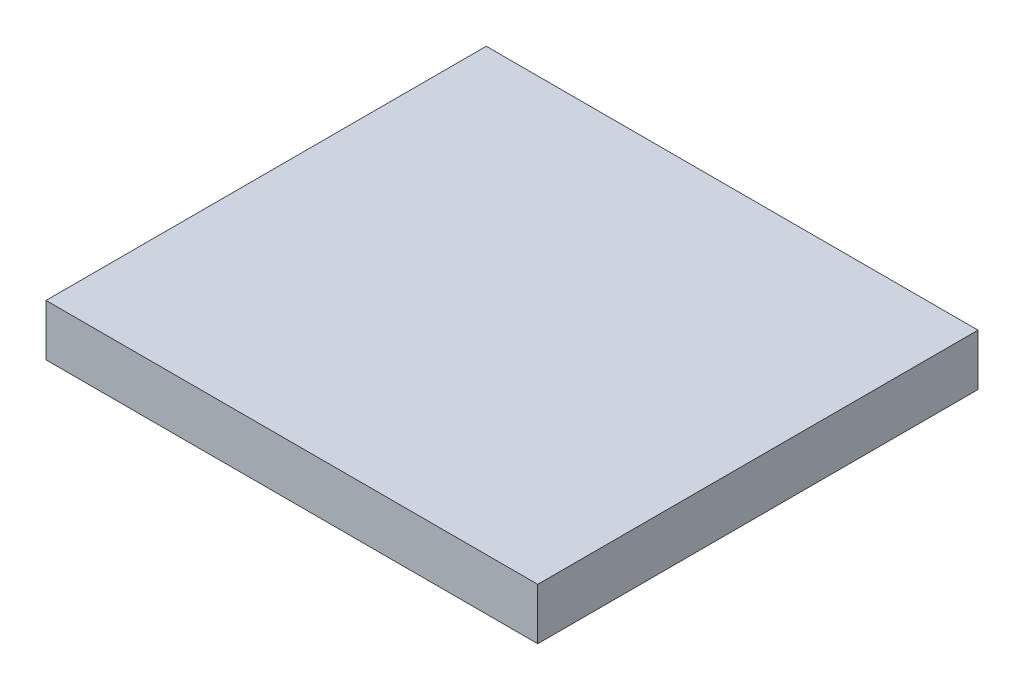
ISO-10303-21;
HEADER;
FILE_DESCRIPTION(('STEP AP214'),'2;1');
FILE_NAME('part.step','',(''),(''),'','','');
FILE_SCHEMA(('AUTOMOTIVE_DESIGN { 1 0 10303 214 1 1 1 1 }'));
ENDSEC;
DATA;
#1=APPLICATION_CONTEXT('core data for automotive mechanical design processes');
#2=APPLICATION_PROTOCOL_DEFINITION('international standard','automotive_design',2000,#1);
#3=PRODUCT_CONTEXT('',#1,'mechanical');
#4=PRODUCT('Part','Part','',(#3));
#5=PRODUCT_RELATED_PRODUCT_CATEGORY('part','',(#4));
#6=PRODUCT_DEFINITION_FORMATION('','',#4);
#7=PRODUCT_DEFINITION_CONTEXT('part definition',#1,'design');
#8=PRODUCT_DEFINITION('design','',#6,#7);
#9=PRODUCT_DEFINITION_SHAPE('','',#8);
#10=(LENGTH_UNIT() NAMED_UNIT(*) SI_UNIT(.MILLI.,.METRE.));
#11=(NAMED_UNIT(*) PLANE_ANGLE_UNIT() SI_UNIT($,.RADIAN.));
#12=(NAMED_UNIT(*) SI_UNIT($,.STERADIAN.) SOLID_ANGLE_UNIT());
#13=UNCERTAINTY_MEASURE_WITH_UNIT(LENGTH_MEASURE(1.E-05),#10,'distance_accuracy_value','');
#14=(GEOMETRIC_REPRESENTATION_CONTEXT(3) GLOBAL_UNCERTAINTY_ASSIGNED_CONTEXT((#13)) GLOBAL_UNIT_ASSIGNED_CONTEXT((#10,
#11,#12)) REPRESENTATION_CONTEXT('',''));
#15=CARTESIAN_POINT('',(0.,0.,0.));
#16=DIRECTION('',(0.,0.,1.));
#17=DIRECTION('',(1.,0.,0.));
#18=AXIS2_PLACEMENT_3D('',#15,#16,#17);
#19=CARTESIAN_POINT('',(-1.11022302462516E-13,9.65199999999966,3.33066907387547E-13));
#20=DIRECTION('',(1.,0.,0.));
#21=DIRECTION('',(0.,0.,-1.));
#22=AXIS2_PLACEMENT_3D('',#19,#20,#21);
#23=PLANE('',#22);
#24=DIRECTION('',(0.,0.,1.));
#25=VECTOR('',#24,1.);
#26=CARTESIAN_POINT('',(0.,0.,0.));
#27=LINE('',#26,#25);
#28=CARTESIAN_POINT('',(-2.22044604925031E-13,-2.22044604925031E-13,-82.5499999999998));
#29=VERTEX_POINT('',#28);
#30=CARTESIAN_POINT('',(0.,0.,0.));
#31=VERTEX_POINT('',#30);
#32=EDGE_CURVE('E70',#29,#31,#27,.T.);
#33=ORIENTED_EDGE('',*,*,#32,.T.);
#34=DIRECTION('',(0.,-1.,0.));
#35=VECTOR('',#34,1.);
#36=CARTESIAN_POINT('',(-1.11022302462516E-13,9.65199999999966,3.33066907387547E-13));
#37=LINE('',#36,#35);
#38=CARTESIAN_POINT('',(-1.11022302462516E-13,9.65199999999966,3.33066907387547E-13));
#39=VERTEX_POINT('',#38);
#40=EDGE_CURVE('E11',#39,#31,#37,.T.);
#41=ORIENTED_EDGE('',*,*,#40,.F.);
#42=DIRECTION('',(0.,0.,1.));
#43=VECTOR('',#42,1.);
#44=CARTESIAN_POINT('',(-1.11022302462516E-13,9.65199999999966,3.33066907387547E-13));
#45=LINE('',#44,#43);
#46=CARTESIAN_POINT('',(-1.11022302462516E-13,9.65199999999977,-82.5499999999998));
#47=VERTEX_POINT('',#46);
#48=EDGE_CURVE('E88',#47,#39,#45,.T.);
#49=ORIENTED_EDGE('',*,*,#48,.F.);
#50=DIRECTION('',(0.,-1.,0.));
#51=VECTOR('',#50,1.);
#52=CARTESIAN_POINT('',(-1.11022302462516E-13,9.65199999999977,-82.5499999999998));
#53=LINE('',#52,#51);
#54=EDGE_CURVE('E82',#47,#29,#53,.T.);
#55=ORIENTED_EDGE('',*,*,#54,.T.);
#56=EDGE_LOOP('',(#33,#41,#49,#55));
#57=FACE_BOUND('',#56,.T.);
#58=ADVANCED_FACE('F26',(#57),#23,.F.);
#59=CARTESIAN_POINT('',(-1.11022302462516E-13,9.65199999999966,3.33066907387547E-13));
#60=DIRECTION('',(0.,0.,-1.));
#61=DIRECTION('',(-1.,0.,0.));
#62=AXIS2_PLACEMENT_3D('',#59,#60,#61);
#63=PLANE('',#62);
#64=DIRECTION('',(1.,0.,0.));
#65=VECTOR('',#64,1.);
#66=CARTESIAN_POINT('',(0.,0.,0.));
#67=LINE('',#66,#65);
#68=CARTESIAN_POINT('',(92.202,-2.22044604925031E-13,6.66133814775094E-13));
#69=VERTEX_POINT('',#68);
#70=EDGE_CURVE('E66',#31,#69,#67,.T.);
#71=ORIENTED_EDGE('',*,*,#70,.T.);
#72=DIRECTION('',(0.,-1.,0.));
#73=VECTOR('',#72,1.);
#74=CARTESIAN_POINT('',(92.2020000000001,9.65199999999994,3.33066907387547E-13));
#75=LINE('',#74,#73);
#76=CARTESIAN_POINT('',(92.2020000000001,9.65199999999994,3.33066907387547E-13));
#77=VERTEX_POINT('',#76);
#78=EDGE_CURVE('E33',#77,#69,#75,.T.);
#79=ORIENTED_EDGE('',*,*,#78,.F.);
#80=DIRECTION('',(1.,0.,0.));
#81=VECTOR('',#80,1.);
#82=CARTESIAN_POINT('',(-1.11022302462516E-13,9.65199999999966,3.33066907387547E-13));
#83=LINE('',#82,#81);
#84=EDGE_CURVE('E78',#39,#77,#83,.T.);
#85=ORIENTED_EDGE('',*,*,#84,.F.);
#86=ORIENTED_EDGE('',*,*,#40,.T.);
#87=EDGE_LOOP('',(#71,#79,#85,#86));
#88=FACE_BOUND('',#87,.T.);
#89=ADVANCED_FACE('F77',(#88),#63,.F.);
#90=CARTESIAN_POINT('',(92.2020000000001,9.65199999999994,3.33066907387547E-13));
#91=DIRECTION('',(-1.,0.,0.));
#92=DIRECTION('',(0.,0.,1.));
#93=AXIS2_PLACEMENT_3D('',#90,#91,#92);
#94=PLANE('',#93);
#95=DIRECTION('',(0.,0.,-1.));
#96=VECTOR('',#95,1.);
#97=CARTESIAN_POINT('',(92.202,-2.22044604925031E-13,6.66133814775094E-13));
#98=LINE('',#97,#96);
#99=CARTESIAN_POINT('',(92.2019999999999,-1.66533453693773E-13,-82.55));
#100=VERTEX_POINT('',#99);
#101=EDGE_CURVE('E71',#69,#100,#98,.T.);
#102=ORIENTED_EDGE('',*,*,#101,.T.);
#103=DIRECTION('',(0.,-1.,0.));
#104=VECTOR('',#103,1.);
#105=CARTESIAN_POINT('',(92.202,9.65199999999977,-82.55));
#106=LINE('',#105,#104);
#107=CARTESIAN_POINT('',(92.202,9.65199999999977,-82.55));
#108=VERTEX_POINT('',#107);
#109=EDGE_CURVE('E94',#108,#100,#106,.T.);
#110=ORIENTED_EDGE('',*,*,#109,.F.);
#111=DIRECTION('',(0.,0.,-1.));
#112=VECTOR('',#111,1.);
#113=CARTESIAN_POINT('',(92.2020000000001,9.65199999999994,3.33066907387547E-13));
#114=LINE('',#113,#112);
#115=EDGE_CURVE('E45',#77,#108,#114,.T.);
#116=ORIENTED_EDGE('',*,*,#115,.F.);
#117=ORIENTED_EDGE('',*,*,#78,.T.);
#118=EDGE_LOOP('',(#102,#110,#116,#117));
#119=FACE_BOUND('',#118,.T.);
#120=ADVANCED_FACE('F97',(#119),#94,.F.);
#121=CARTESIAN_POINT('',(-1.11022302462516E-13,9.65199999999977,-82.5499999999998));
#122=DIRECTION('',(0.,0.,1.));
#123=DIRECTION('',(1.,0.,0.));
#124=AXIS2_PLACEMENT_3D('',#121,#122,#123);
#125=PLANE('',#124);
#126=DIRECTION('',(-1.,0.,0.));
#127=VECTOR('',#126,1.);
#128=CARTESIAN_POINT('',(-2.22044604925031E-13,-2.22044604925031E-13,-82.5499999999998));
#129=LINE('',#128,#127);
#130=EDGE_CURVE('E86',#100,#29,#129,.T.);
#131=ORIENTED_EDGE('',*,*,#130,.T.);
#132=ORIENTED_EDGE('',*,*,#54,.F.);
#133=DIRECTION('',(-1.,0.,0.));
#134=VECTOR('',#133,1.);
#135=CARTESIAN_POINT('',(-1.11022302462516E-13,9.65199999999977,-82.5499999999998));
#136=LINE('',#135,#134);
#137=EDGE_CURVE('E40',#108,#47,#136,.T.);
#138=ORIENTED_EDGE('',*,*,#137,.F.);
#139=ORIENTED_EDGE('',*,*,#109,.T.);
#140=EDGE_LOOP('',(#131,#132,#138,#139));
#141=FACE_BOUND('',#140,.T.);
#142=ADVANCED_FACE('F99',(#141),#125,.F.);
#143=CARTESIAN_POINT('',(-1.11022302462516E-13,9.65199999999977,-82.5499999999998));
#144=DIRECTION('',(0.,-1.,0.));
#145=DIRECTION('',(0.,0.,-1.));
#146=AXIS2_PLACEMENT_3D('',#143,#144,#145);
#147=PLANE('',#146);
#148=ORIENTED_EDGE('',*,*,#48,.T.);
#149=ORIENTED_EDGE('',*,*,#84,.T.);
#150=ORIENTED_EDGE('',*,*,#115,.T.);
#151=ORIENTED_EDGE('',*,*,#137,.T.);
#152=EDGE_LOOP('',(#148,#149,#150,#151));
#153=FACE_BOUND('',#152,.T.);
#154=ADVANCED_FACE('F100',(#153),#147,.F.);
#155=CARTESIAN_POINT('',(-2.22044604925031E-13,-2.22044604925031E-13,-82.5499999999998));
#156=DIRECTION('',(0.,-1.,0.));
#157=DIRECTION('',(0.,0.,-1.));
#158=AXIS2_PLACEMENT_3D('',#155,#156,#157);
#159=PLANE('',#158);
#160=ORIENTED_EDGE('',*,*,#32,.F.);
#161=ORIENTED_EDGE('',*,*,#130,.F.);
#162=ORIENTED_EDGE('',*,*,#101,.F.);
#163=ORIENTED_EDGE('',*,*,#70,.F.);
#164=EDGE_LOOP('',(#160,#161,#162,#163));
#165=FACE_BOUND('',#164,.T.);
#166=ADVANCED_FACE('F67',(#165),#159,.T.);
#167=CLOSED_SHELL('',(#58,#89,#120,#142,#154,#166));
#168=MANIFOLD_SOLID_BREP('B2',#167);
#169=ADVANCED_BREP_SHAPE_REPRESENTATION('',(#18,#168),#14);
#170=SHAPE_DEFINITION_REPRESENTATION(#9,#169);
ENDSEC;
END-ISO-10303-21;
